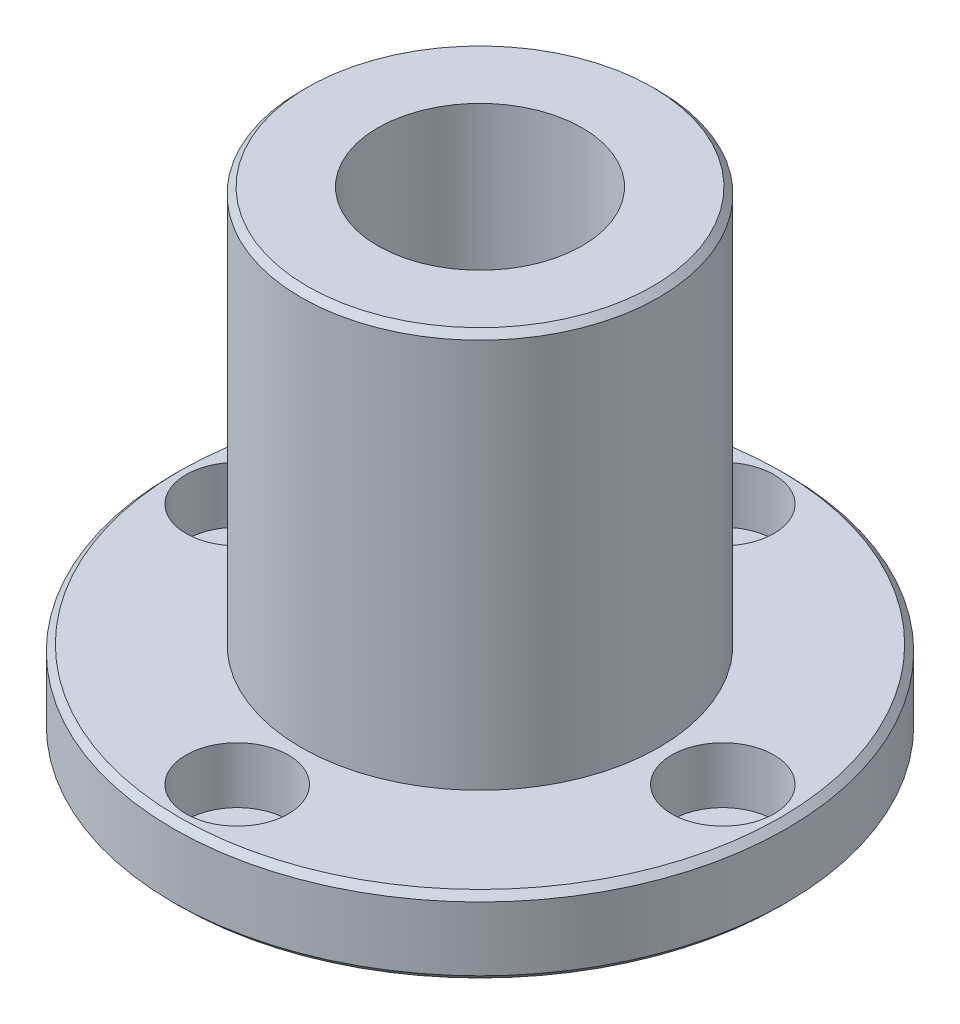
ISO-10303-21;
HEADER;
FILE_DESCRIPTION(('STEP AP214'),'2;1');
FILE_NAME('part.step','',(''),(''),'','','');
FILE_SCHEMA(('AUTOMOTIVE_DESIGN { 1 0 10303 214 1 1 1 1 }'));
ENDSEC;
DATA;
#1=APPLICATION_CONTEXT('core data for automotive mechanical design processes');
#2=APPLICATION_PROTOCOL_DEFINITION('international standard','automotive_design',2000,#1);
#3=PRODUCT_CONTEXT('',#1,'mechanical');
#4=PRODUCT('Part','Part','',(#3));
#5=PRODUCT_RELATED_PRODUCT_CATEGORY('part','',(#4));
#6=PRODUCT_DEFINITION_FORMATION('','',#4);
#7=PRODUCT_DEFINITION_CONTEXT('part definition',#1,'design');
#8=PRODUCT_DEFINITION('design','',#6,#7);
#9=PRODUCT_DEFINITION_SHAPE('','',#8);
#10=(LENGTH_UNIT() NAMED_UNIT(*) SI_UNIT(.MILLI.,.METRE.));
#11=(NAMED_UNIT(*) PLANE_ANGLE_UNIT() SI_UNIT($,.RADIAN.));
#12=(NAMED_UNIT(*) SI_UNIT($,.STERADIAN.) SOLID_ANGLE_UNIT());
#13=UNCERTAINTY_MEASURE_WITH_UNIT(LENGTH_MEASURE(1.E-05),#10,'distance_accuracy_value','');
#14=(GEOMETRIC_REPRESENTATION_CONTEXT(3) GLOBAL_UNCERTAINTY_ASSIGNED_CONTEXT((#13)) GLOBAL_UNIT_ASSIGNED_CONTEXT((#10,
#11,#12)) REPRESENTATION_CONTEXT('',''));
#15=CARTESIAN_POINT('',(0.,0.,0.));
#16=DIRECTION('',(0.,0.,1.));
#17=DIRECTION('',(1.,0.,0.));
#18=AXIS2_PLACEMENT_3D('',#15,#16,#17);
#19=CARTESIAN_POINT('',(0.,0.,0.));
#20=DIRECTION('',(0.,1.,0.));
#21=DIRECTION('',(0.,0.,1.));
#22=AXIS2_PLACEMENT_3D('',#19,#20,#21);
#23=CONICAL_SURFACE('',#22,23.5,0.785398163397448);
#24=CARTESIAN_POINT('',(0.,0.499999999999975,0.));
#25=DIRECTION('',(0.,1.,0.));
#26=DIRECTION('',(0.,0.,1.));
#27=AXIS2_PLACEMENT_3D('',#24,#25,#26);
#28=CIRCLE('',#27,24.);
#29=CARTESIAN_POINT('',(0.,0.499999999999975,24.));
#30=VERTEX_POINT('',#29);
#31=CARTESIAN_POINT('',(0.,0.499999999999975,-24.));
#32=VERTEX_POINT('',#31);
#33=EDGE_CURVE('E463',#30,#32,#28,.T.);
#34=ORIENTED_EDGE('',*,*,#33,.F.);
#35=CARTESIAN_POINT('',(0.,0.499999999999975,0.));
#36=DIRECTION('',(0.,1.,0.));
#37=DIRECTION('',(0.,0.,1.));
#38=AXIS2_PLACEMENT_3D('',#35,#36,#37);
#39=CIRCLE('',#38,24.);
#40=EDGE_CURVE('E465',#32,#30,#39,.T.);
#41=ORIENTED_EDGE('',*,*,#40,.F.);
#42=DIRECTION('',(0.,-0.707106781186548,0.707106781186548));
#43=VECTOR('',#42,1.);
#44=CARTESIAN_POINT('',(0.,0.,-23.5));
#45=LINE('',#44,#43);
#46=CARTESIAN_POINT('',(0.,0.,-23.5));
#47=VERTEX_POINT('',#46);
#48=EDGE_CURVE('E10',#32,#47,#45,.T.);
#49=ORIENTED_EDGE('',*,*,#48,.T.);
#50=CARTESIAN_POINT('',(0.,0.,0.));
#51=DIRECTION('',(0.,-1.,0.));
#52=DIRECTION('',(0.,0.,1.));
#53=AXIS2_PLACEMENT_3D('',#50,#51,#52);
#54=CIRCLE('',#53,23.5);
#55=CARTESIAN_POINT('',(0.,0.,23.5));
#56=VERTEX_POINT('',#55);
#57=EDGE_CURVE('E981',#56,#47,#54,.T.);
#58=ORIENTED_EDGE('',*,*,#57,.F.);
#59=CARTESIAN_POINT('',(0.,0.,0.));
#60=DIRECTION('',(0.,-1.,0.));
#61=DIRECTION('',(0.,0.,1.));
#62=AXIS2_PLACEMENT_3D('',#59,#60,#61);
#63=CIRCLE('',#62,23.5);
#64=EDGE_CURVE('E975',#47,#56,#63,.T.);
#65=ORIENTED_EDGE('',*,*,#64,.F.);
#66=ORIENTED_EDGE('',*,*,#48,.F.);
#67=EDGE_LOOP('',(#34,#41,#49,#58,#65,#66));
#68=FACE_BOUND('',#67,.T.);
#69=ADVANCED_FACE('F16',(#68),#23,.T.);
#70=CARTESIAN_POINT('',(0.,5.5,0.));
#71=DIRECTION('',(0.,-1.,0.));
#72=DIRECTION('',(0.,0.,-1.));
#73=AXIS2_PLACEMENT_3D('',#70,#71,#72);
#74=CONICAL_SURFACE('',#73,24.,0.785398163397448);
#75=CARTESIAN_POINT('',(0.,5.5,0.));
#76=DIRECTION('',(0.,-1.,0.));
#77=DIRECTION('',(0.,0.,-1.));
#78=AXIS2_PLACEMENT_3D('',#75,#76,#77);
#79=CIRCLE('',#78,24.);
#80=CARTESIAN_POINT('',(0.,5.5,-24.));
#81=VERTEX_POINT('',#80);
#82=CARTESIAN_POINT('',(0.,5.5,24.));
#83=VERTEX_POINT('',#82);
#84=EDGE_CURVE('E490',#81,#83,#79,.T.);
#85=ORIENTED_EDGE('',*,*,#84,.F.);
#86=CARTESIAN_POINT('',(0.,5.5,0.));
#87=DIRECTION('',(0.,-1.,0.));
#88=DIRECTION('',(0.,0.,-1.));
#89=AXIS2_PLACEMENT_3D('',#86,#87,#88);
#90=CIRCLE('',#89,24.);
#91=EDGE_CURVE('E487',#83,#81,#90,.T.);
#92=ORIENTED_EDGE('',*,*,#91,.F.);
#93=DIRECTION('',(0.,0.707106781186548,-0.707106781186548));
#94=VECTOR('',#93,1.);
#95=CARTESIAN_POINT('',(0.,5.5,24.));
#96=LINE('',#95,#94);
#97=CARTESIAN_POINT('',(0.,6.,23.5));
#98=VERTEX_POINT('',#97);
#99=EDGE_CURVE('E25',#83,#98,#96,.T.);
#100=ORIENTED_EDGE('',*,*,#99,.T.);
#101=CARTESIAN_POINT('',(0.,6.,0.));
#102=DIRECTION('',(0.,1.,0.));
#103=DIRECTION('',(0.,0.,-1.));
#104=AXIS2_PLACEMENT_3D('',#101,#102,#103);
#105=CIRCLE('',#104,23.5);
#106=CARTESIAN_POINT('',(0.,6.,-23.5));
#107=VERTEX_POINT('',#106);
#108=EDGE_CURVE('E378',#107,#98,#105,.T.);
#109=ORIENTED_EDGE('',*,*,#108,.F.);
#110=CARTESIAN_POINT('',(0.,6.,0.));
#111=DIRECTION('',(0.,1.,0.));
#112=DIRECTION('',(0.,0.,-1.));
#113=AXIS2_PLACEMENT_3D('',#110,#111,#112);
#114=CIRCLE('',#113,23.5);
#115=EDGE_CURVE('E373',#98,#107,#114,.T.);
#116=ORIENTED_EDGE('',*,*,#115,.F.);
#117=ORIENTED_EDGE('',*,*,#99,.F.);
#118=EDGE_LOOP('',(#85,#92,#100,#109,#116,#117));
#119=FACE_BOUND('',#118,.T.);
#120=ADVANCED_FACE('F454',(#119),#74,.T.);
#121=CARTESIAN_POINT('',(0.,36.5,0.));
#122=DIRECTION('',(0.,-1.,0.));
#123=DIRECTION('',(0.,0.,-1.));
#124=AXIS2_PLACEMENT_3D('',#121,#122,#123);
#125=CONICAL_SURFACE('',#124,14.,0.78539816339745);
#126=CARTESIAN_POINT('',(0.,36.5,0.));
#127=DIRECTION('',(0.,-1.,0.));
#128=DIRECTION('',(0.,0.,-1.));
#129=AXIS2_PLACEMENT_3D('',#126,#127,#128);
#130=CIRCLE('',#129,14.);
#131=CARTESIAN_POINT('',(0.,36.5,-14.));
#132=VERTEX_POINT('',#131);
#133=CARTESIAN_POINT('',(0.,36.5,14.));
#134=VERTEX_POINT('',#133);
#135=EDGE_CURVE('E245',#132,#134,#130,.T.);
#136=ORIENTED_EDGE('',*,*,#135,.F.);
#137=CARTESIAN_POINT('',(0.,36.5,0.));
#138=DIRECTION('',(0.,-1.,0.));
#139=DIRECTION('',(0.,0.,-1.));
#140=AXIS2_PLACEMENT_3D('',#137,#138,#139);
#141=CIRCLE('',#140,14.);
#142=EDGE_CURVE('E253',#134,#132,#141,.T.);
#143=ORIENTED_EDGE('',*,*,#142,.F.);
#144=DIRECTION('',(0.,0.707106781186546,-0.707106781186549));
#145=VECTOR('',#144,1.);
#146=CARTESIAN_POINT('',(0.,36.5,14.));
#147=LINE('',#146,#145);
#148=CARTESIAN_POINT('',(0.,37.,13.5));
#149=VERTEX_POINT('',#148);
#150=EDGE_CURVE('E242',#134,#149,#147,.T.);
#151=ORIENTED_EDGE('',*,*,#150,.T.);
#152=CARTESIAN_POINT('',(0.,37.,0.));
#153=DIRECTION('',(0.,1.,0.));
#154=DIRECTION('',(0.,0.,-1.));
#155=AXIS2_PLACEMENT_3D('',#152,#153,#154);
#156=CIRCLE('',#155,13.5);
#157=CARTESIAN_POINT('',(0.,37.,-13.5));
#158=VERTEX_POINT('',#157);
#159=EDGE_CURVE('E255',#158,#149,#156,.T.);
#160=ORIENTED_EDGE('',*,*,#159,.F.);
#161=CARTESIAN_POINT('',(0.,37.,0.));
#162=DIRECTION('',(0.,1.,0.));
#163=DIRECTION('',(0.,0.,-1.));
#164=AXIS2_PLACEMENT_3D('',#161,#162,#163);
#165=CIRCLE('',#164,13.5);
#166=EDGE_CURVE('E248',#149,#158,#165,.T.);
#167=ORIENTED_EDGE('',*,*,#166,.F.);
#168=ORIENTED_EDGE('',*,*,#150,.F.);
#169=EDGE_LOOP('',(#136,#143,#151,#160,#167,#168));
#170=FACE_BOUND('',#169,.T.);
#171=ADVANCED_FACE('F243',(#170),#125,.T.);
#172=CARTESIAN_POINT('',(0.,6.,-19.));
#173=DIRECTION('',(0.,1.,0.));
#174=DIRECTION('',(0.,0.,1.));
#175=AXIS2_PLACEMENT_3D('',#172,#173,#174);
#176=CYLINDRICAL_SURFACE('',#175,4.);
#177=CARTESIAN_POINT('',(0.,1.6,-19.));
#178=DIRECTION('',(0.,1.,0.));
#179=DIRECTION('',(0.,0.,1.));
#180=AXIS2_PLACEMENT_3D('',#177,#178,#179);
#181=CIRCLE('',#180,4.);
#182=CARTESIAN_POINT('',(0.,1.6,-15.));
#183=VERTEX_POINT('',#182);
#184=CARTESIAN_POINT('',(0.,1.6,-23.));
#185=VERTEX_POINT('',#184);
#186=EDGE_CURVE('E352',#183,#185,#181,.T.);
#187=ORIENTED_EDGE('',*,*,#186,.F.);
#188=CARTESIAN_POINT('',(0.,1.6,-19.));
#189=DIRECTION('',(0.,1.,0.));
#190=DIRECTION('',(0.,0.,1.));
#191=AXIS2_PLACEMENT_3D('',#188,#189,#190);
#192=CIRCLE('',#191,4.);
#193=EDGE_CURVE('E356',#185,#183,#192,.T.);
#194=ORIENTED_EDGE('',*,*,#193,.F.);
#195=DIRECTION('',(0.,1.,0.));
#196=VECTOR('',#195,1.);
#197=CARTESIAN_POINT('',(0.,6.,-23.));
#198=LINE('',#197,#196);
#199=CARTESIAN_POINT('',(0.,6.,-23.));
#200=VERTEX_POINT('',#199);
#201=EDGE_CURVE('E37',#185,#200,#198,.T.);
#202=ORIENTED_EDGE('',*,*,#201,.T.);
#203=CARTESIAN_POINT('',(0.,6.,-19.));
#204=DIRECTION('',(0.,1.,0.));
#205=DIRECTION('',(0.,0.,1.));
#206=AXIS2_PLACEMENT_3D('',#203,#204,#205);
#207=CIRCLE('',#206,4.);
#208=CARTESIAN_POINT('',(0.,6.,-15.));
#209=VERTEX_POINT('',#208);
#210=EDGE_CURVE('E363',#200,#209,#207,.T.);
#211=ORIENTED_EDGE('',*,*,#210,.T.);
#212=CARTESIAN_POINT('',(0.,6.,-19.));
#213=DIRECTION('',(0.,1.,0.));
#214=DIRECTION('',(0.,0.,1.));
#215=AXIS2_PLACEMENT_3D('',#212,#213,#214);
#216=CIRCLE('',#215,4.);
#217=EDGE_CURVE('E368',#209,#200,#216,.T.);
#218=ORIENTED_EDGE('',*,*,#217,.T.);
#219=ORIENTED_EDGE('',*,*,#201,.F.);
#220=EDGE_LOOP('',(#187,#194,#202,#211,#218,#219));
#221=FACE_BOUND('',#220,.T.);
#222=ADVANCED_FACE('F362',(#221),#176,.F.);
#223=CARTESIAN_POINT('',(2.25,1.6,-19.));
#224=DIRECTION('',(0.,-1.,0.));
#225=DIRECTION('',(0.,0.,-1.));
#226=AXIS2_PLACEMENT_3D('',#223,#224,#225);
#227=PLANE('',#226);
#228=CARTESIAN_POINT('',(0.,1.6,-19.));
#229=DIRECTION('',(0.,1.,0.));
#230=DIRECTION('',(0.,0.,1.));
#231=AXIS2_PLACEMENT_3D('',#228,#229,#230);
#232=CIRCLE('',#231,2.25);
#233=CARTESIAN_POINT('',(0.,1.6,-16.75));
#234=VERTEX_POINT('',#233);
#235=CARTESIAN_POINT('',(0.,1.6,-21.25));
#236=VERTEX_POINT('',#235);
#237=EDGE_CURVE('E119',#234,#236,#232,.T.);
#238=ORIENTED_EDGE('',*,*,#237,.F.);
#239=CARTESIAN_POINT('',(0.,1.6,-19.));
#240=DIRECTION('',(0.,1.,0.));
#241=DIRECTION('',(0.,0.,1.));
#242=AXIS2_PLACEMENT_3D('',#239,#240,#241);
#243=CIRCLE('',#242,2.25);
#244=EDGE_CURVE('E347',#236,#234,#243,.T.);
#245=ORIENTED_EDGE('',*,*,#244,.F.);
#246=EDGE_LOOP('',(#238,#245));
#247=FACE_BOUND('',#246,.T.);
#248=ORIENTED_EDGE('',*,*,#186,.T.);
#249=ORIENTED_EDGE('',*,*,#193,.T.);
#250=EDGE_LOOP('',(#248,#249));
#251=FACE_BOUND('',#250,.T.);
#252=ADVANCED_FACE('F563',(#247,#251),#227,.F.);
#253=CARTESIAN_POINT('',(0.,6.,-19.));
#254=DIRECTION('',(0.,1.,0.));
#255=DIRECTION('',(0.,0.,1.));
#256=AXIS2_PLACEMENT_3D('',#253,#254,#255);
#257=CYLINDRICAL_SURFACE('',#256,2.25);
#258=CARTESIAN_POINT('',(0.,0.,-19.));
#259=DIRECTION('',(0.,1.,0.));
#260=DIRECTION('',(0.,0.,1.));
#261=AXIS2_PLACEMENT_3D('',#258,#259,#260);
#262=CIRCLE('',#261,2.25);
#263=CARTESIAN_POINT('',(0.,0.,-16.75));
#264=VERTEX_POINT('',#263);
#265=CARTESIAN_POINT('',(0.,0.,-21.25));
#266=VERTEX_POINT('',#265);
#267=EDGE_CURVE('E968',#264,#266,#262,.T.);
#268=ORIENTED_EDGE('',*,*,#267,.F.);
#269=CARTESIAN_POINT('',(0.,0.,-19.));
#270=DIRECTION('',(0.,1.,0.));
#271=DIRECTION('',(0.,0.,1.));
#272=AXIS2_PLACEMENT_3D('',#269,#270,#271);
#273=CIRCLE('',#272,2.25);
#274=EDGE_CURVE('E963',#266,#264,#273,.T.);
#275=ORIENTED_EDGE('',*,*,#274,.F.);
#276=DIRECTION('',(0.,1.,0.));
#277=VECTOR('',#276,1.);
#278=CARTESIAN_POINT('',(0.,6.,-21.25));
#279=LINE('',#278,#277);
#280=EDGE_CURVE('E343',#266,#236,#279,.T.);
#281=ORIENTED_EDGE('',*,*,#280,.T.);
#282=ORIENTED_EDGE('',*,*,#244,.T.);
#283=ORIENTED_EDGE('',*,*,#237,.T.);
#284=ORIENTED_EDGE('',*,*,#280,.F.);
#285=EDGE_LOOP('',(#268,#275,#281,#282,#283,#284));
#286=FACE_BOUND('',#285,.T.);
#287=ADVANCED_FACE('F582',(#286),#257,.F.);
#288=CARTESIAN_POINT('',(19.,6.,0.));
#289=DIRECTION('',(0.,1.,0.));
#290=DIRECTION('',(0.,0.,1.));
#291=AXIS2_PLACEMENT_3D('',#288,#289,#290);
#292=CYLINDRICAL_SURFACE('',#291,4.);
#293=CARTESIAN_POINT('',(19.,1.6,0.));
#294=DIRECTION('',(0.,1.,0.));
#295=DIRECTION('',(0.,0.,1.));
#296=AXIS2_PLACEMENT_3D('',#293,#294,#295);
#297=CIRCLE('',#296,4.);
#298=CARTESIAN_POINT('',(19.,1.6,4.));
#299=VERTEX_POINT('',#298);
#300=CARTESIAN_POINT('',(19.,1.6,-4.));
#301=VERTEX_POINT('',#300);
#302=EDGE_CURVE('E298',#299,#301,#297,.T.);
#303=ORIENTED_EDGE('',*,*,#302,.F.);
#304=CARTESIAN_POINT('',(19.,1.6,0.));
#305=DIRECTION('',(0.,1.,0.));
#306=DIRECTION('',(0.,0.,1.));
#307=AXIS2_PLACEMENT_3D('',#304,#305,#306);
#308=CIRCLE('',#307,4.);
#309=EDGE_CURVE('E302',#301,#299,#308,.T.);
#310=ORIENTED_EDGE('',*,*,#309,.F.);
#311=DIRECTION('',(0.,1.,0.));
#312=VECTOR('',#311,1.);
#313=CARTESIAN_POINT('',(19.,6.,-4.));
#314=LINE('',#313,#312);
#315=CARTESIAN_POINT('',(19.,6.,-4.));
#316=VERTEX_POINT('',#315);
#317=EDGE_CURVE('E340',#301,#316,#314,.T.);
#318=ORIENTED_EDGE('',*,*,#317,.T.);
#319=CARTESIAN_POINT('',(19.,6.,0.));
#320=DIRECTION('',(0.,1.,0.));
#321=DIRECTION('',(0.,0.,1.));
#322=AXIS2_PLACEMENT_3D('',#319,#320,#321);
#323=CIRCLE('',#322,4.);
#324=CARTESIAN_POINT('',(19.,6.,4.));
#325=VERTEX_POINT('',#324);
#326=EDGE_CURVE('E390',#316,#325,#323,.T.);
#327=ORIENTED_EDGE('',*,*,#326,.T.);
#328=CARTESIAN_POINT('',(19.,6.,0.));
#329=DIRECTION('',(0.,1.,0.));
#330=DIRECTION('',(0.,0.,1.));
#331=AXIS2_PLACEMENT_3D('',#328,#329,#330);
#332=CIRCLE('',#331,4.);
#333=EDGE_CURVE('E370',#325,#316,#332,.T.);
#334=ORIENTED_EDGE('',*,*,#333,.T.);
#335=ORIENTED_EDGE('',*,*,#317,.F.);
#336=EDGE_LOOP('',(#303,#310,#318,#327,#334,#335));
#337=FACE_BOUND('',#336,.T.);
#338=ADVANCED_FACE('F429',(#337),#292,.F.);
#339=CARTESIAN_POINT('',(21.25,1.6,0.));
#340=DIRECTION('',(0.,-1.,0.));
#341=DIRECTION('',(0.,0.,-1.));
#342=AXIS2_PLACEMENT_3D('',#339,#340,#341);
#343=PLANE('',#342);
#344=CARTESIAN_POINT('',(19.,1.6,0.));
#345=DIRECTION('',(0.,1.,0.));
#346=DIRECTION('',(0.,0.,1.));
#347=AXIS2_PLACEMENT_3D('',#344,#345,#346);
#348=CIRCLE('',#347,2.25);
#349=CARTESIAN_POINT('',(19.,1.6,2.25));
#350=VERTEX_POINT('',#349);
#351=CARTESIAN_POINT('',(19.,1.6,-2.25));
#352=VERTEX_POINT('',#351);
#353=EDGE_CURVE('E303',#350,#352,#348,.T.);
#354=ORIENTED_EDGE('',*,*,#353,.F.);
#355=CARTESIAN_POINT('',(19.,1.6,0.));
#356=DIRECTION('',(0.,1.,0.));
#357=DIRECTION('',(0.,0.,1.));
#358=AXIS2_PLACEMENT_3D('',#355,#356,#357);
#359=CIRCLE('',#358,2.25);
#360=EDGE_CURVE('E332',#352,#350,#359,.T.);
#361=ORIENTED_EDGE('',*,*,#360,.F.);
#362=EDGE_LOOP('',(#354,#361));
#363=FACE_BOUND('',#362,.T.);
#364=ORIENTED_EDGE('',*,*,#302,.T.);
#365=ORIENTED_EDGE('',*,*,#309,.T.);
#366=EDGE_LOOP('',(#364,#365));
#367=FACE_BOUND('',#366,.T.);
#368=ADVANCED_FACE('F426',(#363,#367),#343,.F.);
#369=CARTESIAN_POINT('',(19.,6.,0.));
#370=DIRECTION('',(0.,1.,0.));
#371=DIRECTION('',(0.,0.,1.));
#372=AXIS2_PLACEMENT_3D('',#369,#370,#371);
#373=CYLINDRICAL_SURFACE('',#372,2.25);
#374=CARTESIAN_POINT('',(19.,0.,0.));
#375=DIRECTION('',(0.,1.,0.));
#376=DIRECTION('',(0.,0.,1.));
#377=AXIS2_PLACEMENT_3D('',#374,#375,#376);
#378=CIRCLE('',#377,2.25);
#379=CARTESIAN_POINT('',(19.,0.,2.25));
#380=VERTEX_POINT('',#379);
#381=CARTESIAN_POINT('',(19.,0.,-2.25));
#382=VERTEX_POINT('',#381);
#383=EDGE_CURVE('E424',#380,#382,#378,.T.);
#384=ORIENTED_EDGE('',*,*,#383,.F.);
#385=CARTESIAN_POINT('',(19.,0.,0.));
#386=DIRECTION('',(0.,1.,0.));
#387=DIRECTION('',(0.,0.,1.));
#388=AXIS2_PLACEMENT_3D('',#385,#386,#387);
#389=CIRCLE('',#388,2.25);
#390=EDGE_CURVE('E422',#382,#380,#389,.T.);
#391=ORIENTED_EDGE('',*,*,#390,.F.);
#392=DIRECTION('',(0.,1.,0.));
#393=VECTOR('',#392,1.);
#394=CARTESIAN_POINT('',(19.,6.,-2.25));
#395=LINE('',#394,#393);
#396=EDGE_CURVE('E270',#382,#352,#395,.T.);
#397=ORIENTED_EDGE('',*,*,#396,.T.);
#398=ORIENTED_EDGE('',*,*,#360,.T.);
#399=ORIENTED_EDGE('',*,*,#353,.T.);
#400=ORIENTED_EDGE('',*,*,#396,.F.);
#401=EDGE_LOOP('',(#384,#391,#397,#398,#399,#400));
#402=FACE_BOUND('',#401,.T.);
#403=ADVANCED_FACE('F420',(#402),#373,.F.);
#404=CARTESIAN_POINT('',(0.,6.,19.));
#405=DIRECTION('',(0.,1.,0.));
#406=DIRECTION('',(0.,0.,1.));
#407=AXIS2_PLACEMENT_3D('',#404,#405,#406);
#408=CYLINDRICAL_SURFACE('',#407,4.);
#409=CARTESIAN_POINT('',(0.,1.6,19.));
#410=DIRECTION('',(0.,1.,0.));
#411=DIRECTION('',(0.,0.,1.));
#412=AXIS2_PLACEMENT_3D('',#409,#410,#411);
#413=CIRCLE('',#412,4.);
#414=CARTESIAN_POINT('',(0.,1.6,23.));
#415=VERTEX_POINT('',#414);
#416=CARTESIAN_POINT('',(0.,1.6,15.));
#417=VERTEX_POINT('',#416);
#418=EDGE_CURVE('E324',#415,#417,#413,.T.);
#419=ORIENTED_EDGE('',*,*,#418,.F.);
#420=CARTESIAN_POINT('',(0.,1.6,19.));
#421=DIRECTION('',(0.,1.,0.));
#422=DIRECTION('',(0.,0.,1.));
#423=AXIS2_PLACEMENT_3D('',#420,#421,#422);
#424=CIRCLE('',#423,4.);
#425=EDGE_CURVE('E328',#417,#415,#424,.T.);
#426=ORIENTED_EDGE('',*,*,#425,.F.);
#427=DIRECTION('',(0.,1.,0.));
#428=VECTOR('',#427,1.);
#429=CARTESIAN_POINT('',(0.,6.,15.));
#430=LINE('',#429,#428);
#431=CARTESIAN_POINT('',(0.,6.,15.));
#432=VERTEX_POINT('',#431);
#433=EDGE_CURVE('E331',#417,#432,#430,.T.);
#434=ORIENTED_EDGE('',*,*,#433,.T.);
#435=CARTESIAN_POINT('',(0.,6.,19.));
#436=DIRECTION('',(0.,1.,0.));
#437=DIRECTION('',(0.,0.,1.));
#438=AXIS2_PLACEMENT_3D('',#435,#436,#437);
#439=CIRCLE('',#438,4.);
#440=CARTESIAN_POINT('',(0.,6.,23.));
#441=VERTEX_POINT('',#440);
#442=EDGE_CURVE('E382',#432,#441,#439,.T.);
#443=ORIENTED_EDGE('',*,*,#442,.T.);
#444=CARTESIAN_POINT('',(0.,6.,19.));
#445=DIRECTION('',(0.,1.,0.));
#446=DIRECTION('',(0.,0.,1.));
#447=AXIS2_PLACEMENT_3D('',#444,#445,#446);
#448=CIRCLE('',#447,4.);
#449=EDGE_CURVE('E385',#441,#432,#448,.T.);
#450=ORIENTED_EDGE('',*,*,#449,.T.);
#451=ORIENTED_EDGE('',*,*,#433,.F.);
#452=EDGE_LOOP('',(#419,#426,#434,#443,#450,#451));
#453=FACE_BOUND('',#452,.T.);
#454=ADVANCED_FACE('F542',(#453),#408,.F.);
#455=CARTESIAN_POINT('',(2.25,1.6,19.));
#456=DIRECTION('',(0.,-1.,0.));
#457=DIRECTION('',(0.,0.,-1.));
#458=AXIS2_PLACEMENT_3D('',#455,#456,#457);
#459=PLANE('',#458);
#460=CARTESIAN_POINT('',(0.,1.6,19.));
#461=DIRECTION('',(0.,1.,0.));
#462=DIRECTION('',(0.,0.,1.));
#463=AXIS2_PLACEMENT_3D('',#460,#461,#462);
#464=CIRCLE('',#463,2.25);
#465=CARTESIAN_POINT('',(0.,1.6,21.25));
#466=VERTEX_POINT('',#465);
#467=CARTESIAN_POINT('',(0.,1.6,16.75));
#468=VERTEX_POINT('',#467);
#469=EDGE_CURVE('E321',#466,#468,#464,.T.);
#470=ORIENTED_EDGE('',*,*,#469,.F.);
#471=CARTESIAN_POINT('',(0.,1.6,19.));
#472=DIRECTION('',(0.,1.,0.));
#473=DIRECTION('',(0.,0.,1.));
#474=AXIS2_PLACEMENT_3D('',#471,#472,#473);
#475=CIRCLE('',#474,2.25);
#476=EDGE_CURVE('E317',#468,#466,#475,.T.);
#477=ORIENTED_EDGE('',*,*,#476,.F.);
#478=EDGE_LOOP('',(#470,#477));
#479=FACE_BOUND('',#478,.T.);
#480=ORIENTED_EDGE('',*,*,#418,.T.);
#481=ORIENTED_EDGE('',*,*,#425,.T.);
#482=EDGE_LOOP('',(#480,#481));
#483=FACE_BOUND('',#482,.T.);
#484=ADVANCED_FACE('F544',(#479,#483),#459,.F.);
#485=CARTESIAN_POINT('',(0.,6.,19.));
#486=DIRECTION('',(0.,1.,0.));
#487=DIRECTION('',(0.,0.,1.));
#488=AXIS2_PLACEMENT_3D('',#485,#486,#487);
#489=CYLINDRICAL_SURFACE('',#488,2.25);
#490=CARTESIAN_POINT('',(0.,0.,19.));
#491=DIRECTION('',(0.,1.,0.));
#492=DIRECTION('',(0.,0.,1.));
#493=AXIS2_PLACEMENT_3D('',#490,#491,#492);
#494=CIRCLE('',#493,2.25);
#495=CARTESIAN_POINT('',(0.,0.,21.25));
#496=VERTEX_POINT('',#495);
#497=CARTESIAN_POINT('',(0.,0.,16.75));
#498=VERTEX_POINT('',#497);
#499=EDGE_CURVE('E507',#496,#498,#494,.T.);
#500=ORIENTED_EDGE('',*,*,#499,.F.);
#501=CARTESIAN_POINT('',(0.,0.,19.));
#502=DIRECTION('',(0.,1.,0.));
#503=DIRECTION('',(0.,0.,1.));
#504=AXIS2_PLACEMENT_3D('',#501,#502,#503);
#505=CIRCLE('',#504,2.25);
#506=EDGE_CURVE('E511',#498,#496,#505,.T.);
#507=ORIENTED_EDGE('',*,*,#506,.F.);
#508=DIRECTION('',(0.,1.,0.));
#509=VECTOR('',#508,1.);
#510=CARTESIAN_POINT('',(0.,6.,16.75));
#511=LINE('',#510,#509);
#512=EDGE_CURVE('E313',#498,#468,#511,.T.);
#513=ORIENTED_EDGE('',*,*,#512,.T.);
#514=ORIENTED_EDGE('',*,*,#476,.T.);
#515=ORIENTED_EDGE('',*,*,#469,.T.);
#516=ORIENTED_EDGE('',*,*,#512,.F.);
#517=EDGE_LOOP('',(#500,#507,#513,#514,#515,#516));
#518=FACE_BOUND('',#517,.T.);
#519=ADVANCED_FACE('F546',(#518),#489,.F.);
#520=CARTESIAN_POINT('',(-19.,6.,0.));
#521=DIRECTION('',(0.,1.,0.));
#522=DIRECTION('',(0.,0.,1.));
#523=AXIS2_PLACEMENT_3D('',#520,#521,#522);
#524=CYLINDRICAL_SURFACE('',#523,4.);
#525=CARTESIAN_POINT('',(-19.,1.6,0.));
#526=DIRECTION('',(0.,1.,0.));
#527=DIRECTION('',(0.,0.,1.));
#528=AXIS2_PLACEMENT_3D('',#525,#526,#527);
#529=CIRCLE('',#528,4.);
#530=CARTESIAN_POINT('',(-19.,1.6,4.));
#531=VERTEX_POINT('',#530);
#532=CARTESIAN_POINT('',(-19.,1.6,-4.));
#533=VERTEX_POINT('',#532);
#534=EDGE_CURVE('E306',#531,#533,#529,.T.);
#535=ORIENTED_EDGE('',*,*,#534,.F.);
#536=CARTESIAN_POINT('',(-19.,1.6,0.));
#537=DIRECTION('',(0.,1.,0.));
#538=DIRECTION('',(0.,0.,1.));
#539=AXIS2_PLACEMENT_3D('',#536,#537,#538);
#540=CIRCLE('',#539,4.);
#541=EDGE_CURVE('E307',#533,#531,#540,.T.);
#542=ORIENTED_EDGE('',*,*,#541,.F.);
#543=DIRECTION('',(0.,1.,0.));
#544=VECTOR('',#543,1.);
#545=CARTESIAN_POINT('',(-19.,6.,-4.));
#546=LINE('',#545,#544);
#547=CARTESIAN_POINT('',(-19.,6.,-4.));
#548=VERTEX_POINT('',#547);
#549=EDGE_CURVE('E309',#533,#548,#546,.T.);
#550=ORIENTED_EDGE('',*,*,#549,.T.);
#551=CARTESIAN_POINT('',(-19.,6.,0.));
#552=DIRECTION('',(0.,1.,0.));
#553=DIRECTION('',(0.,0.,1.));
#554=AXIS2_PLACEMENT_3D('',#551,#552,#553);
#555=CIRCLE('',#554,4.);
#556=CARTESIAN_POINT('',(-19.,6.,4.));
#557=VERTEX_POINT('',#556);
#558=EDGE_CURVE('E399',#548,#557,#555,.T.);
#559=ORIENTED_EDGE('',*,*,#558,.T.);
#560=CARTESIAN_POINT('',(-19.,6.,0.));
#561=DIRECTION('',(0.,1.,0.));
#562=DIRECTION('',(0.,0.,1.));
#563=AXIS2_PLACEMENT_3D('',#560,#561,#562);
#564=CIRCLE('',#563,4.);
#565=EDGE_CURVE('E384',#557,#548,#564,.T.);
#566=ORIENTED_EDGE('',*,*,#565,.T.);
#567=ORIENTED_EDGE('',*,*,#549,.F.);
#568=EDGE_LOOP('',(#535,#542,#550,#559,#566,#567));
#569=FACE_BOUND('',#568,.T.);
#570=ADVANCED_FACE('F532',(#569),#524,.F.);
#571=CARTESIAN_POINT('',(-16.75,1.6,0.));
#572=DIRECTION('',(0.,-1.,0.));
#573=DIRECTION('',(0.,0.,-1.));
#574=AXIS2_PLACEMENT_3D('',#571,#572,#573);
#575=PLANE('',#574);
#576=CARTESIAN_POINT('',(-19.,1.6,0.));
#577=DIRECTION('',(0.,1.,0.));
#578=DIRECTION('',(0.,0.,1.));
#579=AXIS2_PLACEMENT_3D('',#576,#577,#578);
#580=CIRCLE('',#579,2.25);
#581=CARTESIAN_POINT('',(-19.,1.6,2.25));
#582=VERTEX_POINT('',#581);
#583=CARTESIAN_POINT('',(-19.,1.6,-2.25));
#584=VERTEX_POINT('',#583);
#585=EDGE_CURVE('E297',#582,#584,#580,.T.);
#586=ORIENTED_EDGE('',*,*,#585,.F.);
#587=CARTESIAN_POINT('',(-19.,1.6,0.));
#588=DIRECTION('',(0.,1.,0.));
#589=DIRECTION('',(0.,0.,1.));
#590=AXIS2_PLACEMENT_3D('',#587,#588,#589);
#591=CIRCLE('',#590,2.25);
#592=EDGE_CURVE('E293',#584,#582,#591,.T.);
#593=ORIENTED_EDGE('',*,*,#592,.F.);
#594=EDGE_LOOP('',(#586,#593));
#595=FACE_BOUND('',#594,.T.);
#596=ORIENTED_EDGE('',*,*,#534,.T.);
#597=ORIENTED_EDGE('',*,*,#541,.T.);
#598=EDGE_LOOP('',(#596,#597));
#599=FACE_BOUND('',#598,.T.);
#600=ADVANCED_FACE('F529',(#595,#599),#575,.F.);
#601=CARTESIAN_POINT('',(-19.,6.,0.));
#602=DIRECTION('',(0.,1.,0.));
#603=DIRECTION('',(0.,0.,1.));
#604=AXIS2_PLACEMENT_3D('',#601,#602,#603);
#605=CYLINDRICAL_SURFACE('',#604,2.25);
#606=CARTESIAN_POINT('',(-19.,0.,0.));
#607=DIRECTION('',(0.,1.,0.));
#608=DIRECTION('',(0.,0.,1.));
#609=AXIS2_PLACEMENT_3D('',#606,#607,#608);
#610=CIRCLE('',#609,2.25);
#611=CARTESIAN_POINT('',(-19.,0.,2.25));
#612=VERTEX_POINT('',#611);
#613=CARTESIAN_POINT('',(-19.,0.,-2.25));
#614=VERTEX_POINT('',#613);
#615=EDGE_CURVE('E480',#612,#614,#610,.T.);
#616=ORIENTED_EDGE('',*,*,#615,.F.);
#617=CARTESIAN_POINT('',(-19.,0.,0.));
#618=DIRECTION('',(0.,1.,0.));
#619=DIRECTION('',(0.,0.,1.));
#620=AXIS2_PLACEMENT_3D('',#617,#618,#619);
#621=CIRCLE('',#620,2.25);
#622=EDGE_CURVE('E481',#614,#612,#621,.T.);
#623=ORIENTED_EDGE('',*,*,#622,.F.);
#624=DIRECTION('',(0.,1.,0.));
#625=VECTOR('',#624,1.);
#626=CARTESIAN_POINT('',(-19.,6.,-2.25));
#627=LINE('',#626,#625);
#628=EDGE_CURVE('E289',#614,#584,#627,.T.);
#629=ORIENTED_EDGE('',*,*,#628,.T.);
#630=ORIENTED_EDGE('',*,*,#592,.T.);
#631=ORIENTED_EDGE('',*,*,#585,.T.);
#632=ORIENTED_EDGE('',*,*,#628,.F.);
#633=EDGE_LOOP('',(#616,#623,#629,#630,#631,#632));
#634=FACE_BOUND('',#633,.T.);
#635=ADVANCED_FACE('F526',(#634),#605,.F.);
#636=CARTESIAN_POINT('',(0.,37.,0.));
#637=DIRECTION('',(0.,-1.,0.));
#638=DIRECTION('',(0.,0.,-1.));
#639=AXIS2_PLACEMENT_3D('',#636,#637,#638);
#640=CYLINDRICAL_SURFACE('',#639,8.);
#641=CARTESIAN_POINT('',(0.,37.,0.));
#642=DIRECTION('',(0.,-1.,0.));
#643=DIRECTION('',(0.,0.,-1.));
#644=AXIS2_PLACEMENT_3D('',#641,#642,#643);
#645=CIRCLE('',#644,8.);
#646=CARTESIAN_POINT('',(0.,37.,-8.));
#647=VERTEX_POINT('',#646);
#648=CARTESIAN_POINT('',(0.,37.,8.));
#649=VERTEX_POINT('',#648);
#650=EDGE_CURVE('E276',#647,#649,#645,.T.);
#651=ORIENTED_EDGE('',*,*,#650,.F.);
#652=CARTESIAN_POINT('',(0.,37.,0.));
#653=DIRECTION('',(0.,-1.,0.));
#654=DIRECTION('',(0.,0.,-1.));
#655=AXIS2_PLACEMENT_3D('',#652,#653,#654);
#656=CIRCLE('',#655,8.);
#657=EDGE_CURVE('E282',#649,#647,#656,.T.);
#658=ORIENTED_EDGE('',*,*,#657,.F.);
#659=DIRECTION('',(0.,-1.,0.));
#660=VECTOR('',#659,1.);
#661=CARTESIAN_POINT('',(0.,37.,8.));
#662=LINE('',#661,#660);
#663=CARTESIAN_POINT('',(0.,0.,8.));
#664=VERTEX_POINT('',#663);
#665=EDGE_CURVE('E285',#649,#664,#662,.T.);
#666=ORIENTED_EDGE('',*,*,#665,.T.);
#667=CARTESIAN_POINT('',(0.,0.,0.));
#668=DIRECTION('',(0.,-1.,0.));
#669=DIRECTION('',(0.,0.,-1.));
#670=AXIS2_PLACEMENT_3D('',#667,#668,#669);
#671=CIRCLE('',#670,8.);
#672=CARTESIAN_POINT('',(0.,0.,-8.));
#673=VERTEX_POINT('',#672);
#674=EDGE_CURVE('E468',#664,#673,#671,.T.);
#675=ORIENTED_EDGE('',*,*,#674,.T.);
#676=CARTESIAN_POINT('',(0.,0.,0.));
#677=DIRECTION('',(0.,-1.,0.));
#678=DIRECTION('',(0.,0.,-1.));
#679=AXIS2_PLACEMENT_3D('',#676,#677,#678);
#680=CIRCLE('',#679,8.);
#681=EDGE_CURVE('E476',#673,#664,#680,.T.);
#682=ORIENTED_EDGE('',*,*,#681,.T.);
#683=ORIENTED_EDGE('',*,*,#665,.F.);
#684=EDGE_LOOP('',(#651,#658,#666,#675,#682,#683));
#685=FACE_BOUND('',#684,.T.);
#686=ADVANCED_FACE('F646',(#685),#640,.F.);
#687=CARTESIAN_POINT('',(-14.,37.,0.));
#688=DIRECTION('',(0.,-1.,0.));
#689=DIRECTION('',(0.,0.,-1.));
#690=AXIS2_PLACEMENT_3D('',#687,#688,#689);
#691=PLANE('',#690);
#692=ORIENTED_EDGE('',*,*,#650,.T.);
#693=ORIENTED_EDGE('',*,*,#657,.T.);
#694=EDGE_LOOP('',(#692,#693));
#695=FACE_BOUND('',#694,.T.);
#696=ORIENTED_EDGE('',*,*,#159,.T.);
#697=ORIENTED_EDGE('',*,*,#166,.T.);
#698=EDGE_LOOP('',(#696,#697));
#699=FACE_BOUND('',#698,.T.);
#700=ADVANCED_FACE('F449',(#695,#699),#691,.F.);
#701=CARTESIAN_POINT('',(0.,0.,0.));
#702=DIRECTION('',(0.,-1.,0.));
#703=DIRECTION('',(0.,0.,-1.));
#704=AXIS2_PLACEMENT_3D('',#701,#702,#703);
#705=CYLINDRICAL_SURFACE('',#704,14.);
#706=CARTESIAN_POINT('',(0.,6.,0.));
#707=DIRECTION('',(0.,-1.,0.));
#708=DIRECTION('',(0.,0.,-1.));
#709=AXIS2_PLACEMENT_3D('',#706,#707,#708);
#710=CIRCLE('',#709,14.);
#711=CARTESIAN_POINT('',(0.,6.,-14.));
#712=VERTEX_POINT('',#711);
#713=CARTESIAN_POINT('',(0.,6.,14.));
#714=VERTEX_POINT('',#713);
#715=EDGE_CURVE('E267',#712,#714,#710,.T.);
#716=ORIENTED_EDGE('',*,*,#715,.F.);
#717=CARTESIAN_POINT('',(0.,6.,0.));
#718=DIRECTION('',(0.,-1.,0.));
#719=DIRECTION('',(0.,0.,-1.));
#720=AXIS2_PLACEMENT_3D('',#717,#718,#719);
#721=CIRCLE('',#720,14.);
#722=EDGE_CURVE('E259',#714,#712,#721,.T.);
#723=ORIENTED_EDGE('',*,*,#722,.F.);
#724=DIRECTION('',(0.,1.,0.));
#725=VECTOR('',#724,1.);
#726=CARTESIAN_POINT('',(0.,0.,14.));
#727=LINE('',#726,#725);
#728=EDGE_CURVE('E236',#714,#134,#727,.T.);
#729=ORIENTED_EDGE('',*,*,#728,.T.);
#730=ORIENTED_EDGE('',*,*,#142,.T.);
#731=ORIENTED_EDGE('',*,*,#135,.T.);
#732=ORIENTED_EDGE('',*,*,#728,.F.);
#733=EDGE_LOOP('',(#716,#723,#729,#730,#731,#732));
#734=FACE_BOUND('',#733,.T.);
#735=ADVANCED_FACE('F252',(#734),#705,.T.);
#736=CARTESIAN_POINT('',(-24.,6.,0.));
#737=DIRECTION('',(0.,-1.,0.));
#738=DIRECTION('',(0.,0.,-1.));
#739=AXIS2_PLACEMENT_3D('',#736,#737,#738);
#740=PLANE('',#739);
#741=ORIENTED_EDGE('',*,*,#715,.T.);
#742=ORIENTED_EDGE('',*,*,#722,.T.);
#743=EDGE_LOOP('',(#741,#742));
#744=FACE_BOUND('',#743,.T.);
#745=ORIENTED_EDGE('',*,*,#565,.F.);
#746=ORIENTED_EDGE('',*,*,#558,.F.);
#747=EDGE_LOOP('',(#745,#746));
#748=FACE_BOUND('',#747,.T.);
#749=ORIENTED_EDGE('',*,*,#449,.F.);
#750=ORIENTED_EDGE('',*,*,#442,.F.);
#751=EDGE_LOOP('',(#749,#750));
#752=FACE_BOUND('',#751,.T.);
#753=ORIENTED_EDGE('',*,*,#333,.F.);
#754=ORIENTED_EDGE('',*,*,#326,.F.);
#755=EDGE_LOOP('',(#753,#754));
#756=FACE_BOUND('',#755,.T.);
#757=ORIENTED_EDGE('',*,*,#217,.F.);
#758=ORIENTED_EDGE('',*,*,#210,.F.);
#759=EDGE_LOOP('',(#757,#758));
#760=FACE_BOUND('',#759,.T.);
#761=ORIENTED_EDGE('',*,*,#108,.T.);
#762=ORIENTED_EDGE('',*,*,#115,.T.);
#763=EDGE_LOOP('',(#761,#762));
#764=FACE_BOUND('',#763,.T.);
#765=ADVANCED_FACE('F366',(#744,#748,#752,#756,#760,#764),#740,.F.);
#766=CARTESIAN_POINT('',(0.,0.,0.));
#767=DIRECTION('',(0.,-1.,0.));
#768=DIRECTION('',(0.,0.,-1.));
#769=AXIS2_PLACEMENT_3D('',#766,#767,#768);
#770=CYLINDRICAL_SURFACE('',#769,24.);
#771=ORIENTED_EDGE('',*,*,#33,.T.);
#772=ORIENTED_EDGE('',*,*,#40,.T.);
#773=DIRECTION('',(0.,1.,0.));
#774=VECTOR('',#773,1.);
#775=CARTESIAN_POINT('',(0.,0.,24.));
#776=LINE('',#775,#774);
#777=EDGE_CURVE('E474',#30,#83,#776,.T.);
#778=ORIENTED_EDGE('',*,*,#777,.T.);
#779=ORIENTED_EDGE('',*,*,#91,.T.);
#780=ORIENTED_EDGE('',*,*,#84,.T.);
#781=ORIENTED_EDGE('',*,*,#777,.F.);
#782=EDGE_LOOP('',(#771,#772,#778,#779,#780,#781));
#783=FACE_BOUND('',#782,.T.);
#784=ADVANCED_FACE('F438',(#783),#770,.T.);
#785=CARTESIAN_POINT('',(0.,0.,0.));
#786=DIRECTION('',(0.,1.,0.));
#787=DIRECTION('',(1.,0.,0.));
#788=AXIS2_PLACEMENT_3D('',#785,#786,#787);
#789=PLANE('',#788);
#790=ORIENTED_EDGE('',*,*,#681,.F.);
#791=ORIENTED_EDGE('',*,*,#674,.F.);
#792=EDGE_LOOP('',(#790,#791));
#793=FACE_BOUND('',#792,.T.);
#794=ORIENTED_EDGE('',*,*,#615,.T.);
#795=ORIENTED_EDGE('',*,*,#622,.T.);
#796=EDGE_LOOP('',(#794,#795));
#797=FACE_BOUND('',#796,.T.);
#798=ORIENTED_EDGE('',*,*,#499,.T.);
#799=ORIENTED_EDGE('',*,*,#506,.T.);
#800=EDGE_LOOP('',(#798,#799));
#801=FACE_BOUND('',#800,.T.);
#802=ORIENTED_EDGE('',*,*,#383,.T.);
#803=ORIENTED_EDGE('',*,*,#390,.T.);
#804=EDGE_LOOP('',(#802,#803));
#805=FACE_BOUND('',#804,.T.);
#806=ORIENTED_EDGE('',*,*,#267,.T.);
#807=ORIENTED_EDGE('',*,*,#274,.T.);
#808=EDGE_LOOP('',(#806,#807));
#809=FACE_BOUND('',#808,.T.);
#810=ORIENTED_EDGE('',*,*,#57,.T.);
#811=ORIENTED_EDGE('',*,*,#64,.T.);
#812=EDGE_LOOP('',(#810,#811));
#813=FACE_BOUND('',#812,.T.);
#814=ADVANCED_FACE('F446',(#793,#797,#801,#805,#809,#813),#789,.F.);
#815=CLOSED_SHELL('',(#69,#120,#171,#222,#252,#287,#338,#368,#403,#454,#484,#519,#570,#600,#635,
#686,#700,#735,#765,#784,#814));
#816=MANIFOLD_SOLID_BREP('B1',#815);
#817=ADVANCED_BREP_SHAPE_REPRESENTATION('',(#18,#816),#14);
#818=SHAPE_DEFINITION_REPRESENTATION(#9,#817);
ENDSEC;
END-ISO-10303-21;
